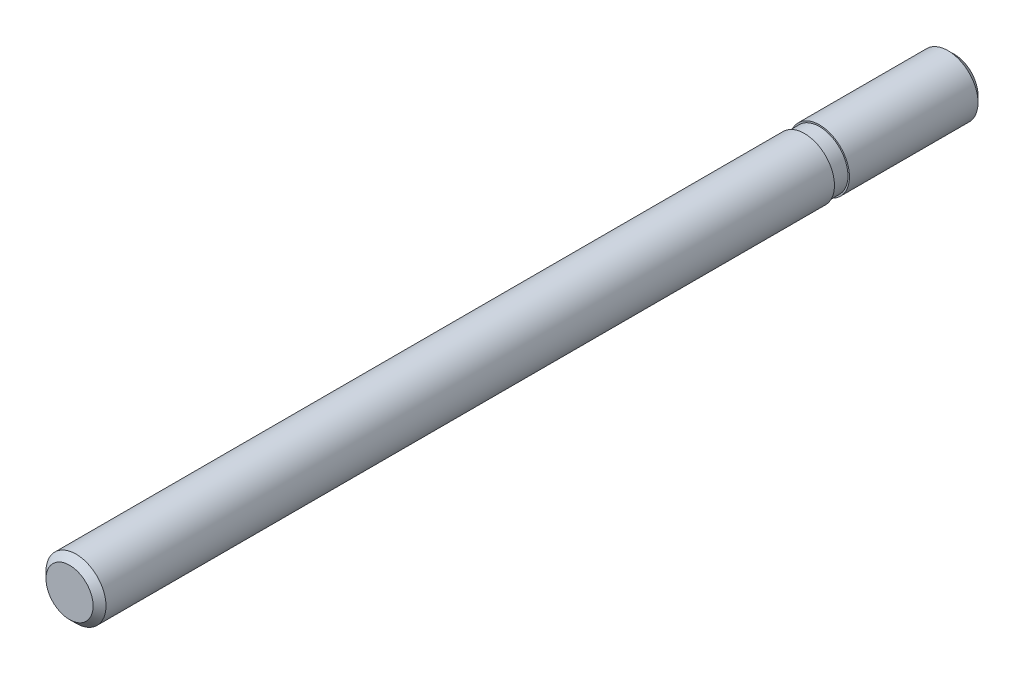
ISO-10303-21;
HEADER;
FILE_DESCRIPTION(('STEP AP214'),'2;1');
FILE_NAME('part.step','',(''),(''),'','','');
FILE_SCHEMA(('AUTOMOTIVE_DESIGN { 1 0 10303 214 1 1 1 1 }'));
ENDSEC;
DATA;
#1=APPLICATION_CONTEXT('core data for automotive mechanical design processes');
#2=APPLICATION_PROTOCOL_DEFINITION('international standard','automotive_design',2000,#1);
#3=PRODUCT_CONTEXT('',#1,'mechanical');
#4=PRODUCT('Part','Part','',(#3));
#5=PRODUCT_RELATED_PRODUCT_CATEGORY('part','',(#4));
#6=PRODUCT_DEFINITION_FORMATION('','',#4);
#7=PRODUCT_DEFINITION_CONTEXT('part definition',#1,'design');
#8=PRODUCT_DEFINITION('design','',#6,#7);
#9=PRODUCT_DEFINITION_SHAPE('','',#8);
#10=(LENGTH_UNIT() NAMED_UNIT(*) SI_UNIT(.MILLI.,.METRE.));
#11=(NAMED_UNIT(*) PLANE_ANGLE_UNIT() SI_UNIT($,.RADIAN.));
#12=(NAMED_UNIT(*) SI_UNIT($,.STERADIAN.) SOLID_ANGLE_UNIT());
#13=UNCERTAINTY_MEASURE_WITH_UNIT(LENGTH_MEASURE(1.E-05),#10,'distance_accuracy_value','');
#14=(GEOMETRIC_REPRESENTATION_CONTEXT(3) GLOBAL_UNCERTAINTY_ASSIGNED_CONTEXT((#13)) GLOBAL_UNIT_ASSIGNED_CONTEXT((#10,
#11,#12)) REPRESENTATION_CONTEXT('',''));
#15=CARTESIAN_POINT('',(0.,0.,0.));
#16=DIRECTION('',(0.,0.,1.));
#17=DIRECTION('',(1.,0.,0.));
#18=AXIS2_PLACEMENT_3D('',#15,#16,#17);
#19=CARTESIAN_POINT('',(0.,0.,7.5));
#20=DIRECTION('',(0.,0.,1.));
#21=DIRECTION('',(1.,0.,0.));
#22=AXIS2_PLACEMENT_3D('',#19,#20,#21);
#23=CYLINDRICAL_SURFACE('',#22,2.);
#24=CARTESIAN_POINT('',(0.,0.,0.));
#25=DIRECTION('',(0.,0.,1.));
#26=DIRECTION('',(1.,0.,0.));
#27=AXIS2_PLACEMENT_3D('',#24,#25,#26);
#28=CIRCLE('',#27,2.);
#29=CARTESIAN_POINT('',(2.,0.,0.));
#30=VERTEX_POINT('',#29);
#31=EDGE_CURVE('E19',#30,#30,#28,.T.);
#32=ORIENTED_EDGE('',*,*,#31,.F.);
#33=EDGE_LOOP('',(#32));
#34=FACE_BOUND('',#33,.T.);
#35=CARTESIAN_POINT('',(0.,0.,-8.5705));
#36=DIRECTION('',(0.,0.,1.));
#37=DIRECTION('',(1.,0.,0.));
#38=AXIS2_PLACEMENT_3D('',#35,#36,#37);
#39=CIRCLE('',#38,2.);
#40=CARTESIAN_POINT('',(2.,0.,-8.5705));
#41=VERTEX_POINT('',#40);
#42=EDGE_CURVE('E33',#41,#41,#39,.T.);
#43=ORIENTED_EDGE('',*,*,#42,.T.);
#44=EDGE_LOOP('',(#43));
#45=FACE_BOUND('',#44,.T.);
#46=ADVANCED_FACE('F12',(#34,#45),#23,.T.);
#47=CARTESIAN_POINT('',(0.,0.,0.));
#48=DIRECTION('',(0.,0.,1.));
#49=DIRECTION('',(1.,0.,0.));
#50=AXIS2_PLACEMENT_3D('',#47,#48,#49);
#51=PLANE('',#50);
#52=CARTESIAN_POINT('',(0.,0.,0.));
#53=DIRECTION('',(0.,0.,1.));
#54=DIRECTION('',(1.,0.,0.));
#55=AXIS2_PLACEMENT_3D('',#52,#53,#54);
#56=CIRCLE('',#55,1.9);
#57=CARTESIAN_POINT('',(1.9,0.,0.));
#58=VERTEX_POINT('',#57);
#59=EDGE_CURVE('E8',#58,#58,#56,.T.);
#60=ORIENTED_EDGE('',*,*,#59,.F.);
#61=EDGE_LOOP('',(#60));
#62=FACE_BOUND('',#61,.T.);
#63=ORIENTED_EDGE('',*,*,#31,.T.);
#64=EDGE_LOOP('',(#63));
#65=FACE_BOUND('',#64,.T.);
#66=ADVANCED_FACE('F69',(#62,#65),#51,.T.);
#67=CARTESIAN_POINT('',(0.,0.78525,-9.));
#68=DIRECTION('',(0.,0.,-1.));
#69=DIRECTION('',(-1.,0.,0.));
#70=AXIS2_PLACEMENT_3D('',#67,#68,#69);
#71=PLANE('',#70);
#72=CARTESIAN_POINT('',(0.,0.,-8.99999999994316));
#73=DIRECTION('',(0.,0.,1.));
#74=DIRECTION('',(1.,0.,0.));
#75=AXIS2_PLACEMENT_3D('',#72,#73,#74);
#76=CIRCLE('',#75,1.57050000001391);
#77=CARTESIAN_POINT('',(1.57050000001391,0.,-8.99999999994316));
#78=VERTEX_POINT('',#77);
#79=EDGE_CURVE('E36',#78,#78,#76,.T.);
#80=ORIENTED_EDGE('',*,*,#79,.F.);
#81=EDGE_LOOP('',(#80));
#82=FACE_BOUND('',#81,.T.);
#83=ADVANCED_FACE('F71',(#82),#71,.T.);
#84=CARTESIAN_POINT('',(0.,0.,-8.5705000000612));
#85=DIRECTION('',(0.,0.,1.));
#86=DIRECTION('',(1.,0.,0.));
#87=AXIS2_PLACEMENT_3D('',#84,#85,#86);
#88=CONICAL_SURFACE('',#87,1.9999999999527,0.785398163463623);
#89=ORIENTED_EDGE('',*,*,#42,.F.);
#90=EDGE_LOOP('',(#89));
#91=FACE_BOUND('',#90,.T.);
#92=ORIENTED_EDGE('',*,*,#79,.T.);
#93=EDGE_LOOP('',(#92));
#94=FACE_BOUND('',#93,.T.);
#95=ADVANCED_FACE('F79',(#91,#94),#88,.T.);
#96=CARTESIAN_POINT('',(0.,0.,-1.20159218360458));
#97=DIRECTION('',(0.,0.,-1.));
#98=DIRECTION('',(-1.,0.,0.));
#99=AXIS2_PLACEMENT_3D('',#96,#97,#98);
#100=CYLINDRICAL_SURFACE('',#99,1.9);
#101=CARTESIAN_POINT('',(0.,0.,1.));
#102=DIRECTION('',(0.,0.,-1.));
#103=DIRECTION('',(-1.,0.,0.));
#104=AXIS2_PLACEMENT_3D('',#101,#102,#103);
#105=CIRCLE('',#104,1.9);
#106=CARTESIAN_POINT('',(-1.9,0.,1.));
#107=VERTEX_POINT('',#106);
#108=EDGE_CURVE('E39',#107,#107,#105,.T.);
#109=ORIENTED_EDGE('',*,*,#108,.T.);
#110=EDGE_LOOP('',(#109));
#111=FACE_BOUND('',#110,.T.);
#112=ORIENTED_EDGE('',*,*,#59,.T.);
#113=EDGE_LOOP('',(#112));
#114=FACE_BOUND('',#113,.T.);
#115=ADVANCED_FACE('F45',(#111,#114),#100,.T.);
#116=CARTESIAN_POINT('',(0.,0.78525,50.));
#117=DIRECTION('',(0.,0.,1.));
#118=DIRECTION('',(1.,0.,0.));
#119=AXIS2_PLACEMENT_3D('',#116,#117,#118);
#120=PLANE('',#119);
#121=CARTESIAN_POINT('',(0.,0.,49.99999999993));
#122=DIRECTION('',(0.,0.,-1.));
#123=DIRECTION('',(-1.,0.,0.));
#124=AXIS2_PLACEMENT_3D('',#121,#122,#123);
#125=CIRCLE('',#124,1.57050000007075);
#126=CARTESIAN_POINT('',(-1.57050000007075,0.,49.99999999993));
#127=VERTEX_POINT('',#126);
#128=EDGE_CURVE('E30',#127,#127,#125,.T.);
#129=ORIENTED_EDGE('',*,*,#128,.F.);
#130=EDGE_LOOP('',(#129));
#131=FACE_BOUND('',#130,.T.);
#132=ADVANCED_FACE('F59',(#131),#120,.T.);
#133=CARTESIAN_POINT('',(0.,0.,49.5705000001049));
#134=DIRECTION('',(0.,0.,-1.));
#135=DIRECTION('',(-1.,0.,0.));
#136=AXIS2_PLACEMENT_3D('',#133,#134,#135);
#137=CONICAL_SURFACE('',#136,1.9999999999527,0.785398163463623);
#138=ORIENTED_EDGE('',*,*,#128,.T.);
#139=EDGE_LOOP('',(#138));
#140=FACE_BOUND('',#139,.T.);
#141=CARTESIAN_POINT('',(0.,0.,49.5705));
#142=DIRECTION('',(0.,0.,1.));
#143=DIRECTION('',(1.,0.,0.));
#144=AXIS2_PLACEMENT_3D('',#141,#142,#143);
#145=CIRCLE('',#144,2.);
#146=CARTESIAN_POINT('',(2.,0.,49.5705));
#147=VERTEX_POINT('',#146);
#148=EDGE_CURVE('E28',#147,#147,#145,.F.);
#149=ORIENTED_EDGE('',*,*,#148,.F.);
#150=EDGE_LOOP('',(#149));
#151=FACE_BOUND('',#150,.T.);
#152=ADVANCED_FACE('F55',(#140,#151),#137,.T.);
#153=CARTESIAN_POINT('',(0.,0.,7.5));
#154=DIRECTION('',(0.,0.,1.));
#155=DIRECTION('',(1.,0.,0.));
#156=AXIS2_PLACEMENT_3D('',#153,#154,#155);
#157=CYLINDRICAL_SURFACE('',#156,2.);
#158=CARTESIAN_POINT('',(0.,0.,1.));
#159=DIRECTION('',(0.,0.,1.));
#160=DIRECTION('',(1.,0.,0.));
#161=AXIS2_PLACEMENT_3D('',#158,#159,#160);
#162=CIRCLE('',#161,2.);
#163=CARTESIAN_POINT('',(2.,0.,1.));
#164=VERTEX_POINT('',#163);
#165=EDGE_CURVE('E23',#164,#164,#162,.T.);
#166=ORIENTED_EDGE('',*,*,#165,.T.);
#167=EDGE_LOOP('',(#166));
#168=FACE_BOUND('',#167,.T.);
#169=ORIENTED_EDGE('',*,*,#148,.T.);
#170=EDGE_LOOP('',(#169));
#171=FACE_BOUND('',#170,.T.);
#172=ADVANCED_FACE('F14',(#168,#171),#157,.T.);
#173=CARTESIAN_POINT('',(0.,0.,1.));
#174=DIRECTION('',(0.,0.,1.));
#175=DIRECTION('',(1.,0.,0.));
#176=AXIS2_PLACEMENT_3D('',#173,#174,#175);
#177=PLANE('',#176);
#178=ORIENTED_EDGE('',*,*,#108,.F.);
#179=EDGE_LOOP('',(#178));
#180=FACE_BOUND('',#179,.T.);
#181=ORIENTED_EDGE('',*,*,#165,.F.);
#182=EDGE_LOOP('',(#181));
#183=FACE_BOUND('',#182,.T.);
#184=ADVANCED_FACE('F47',(#180,#183),#177,.F.);
#185=CLOSED_SHELL('',(#46,#66,#83,#95,#115,#132,#152,#172,#184));
#186=MANIFOLD_SOLID_BREP('B1',#185);
#187=ADVANCED_BREP_SHAPE_REPRESENTATION('',(#18,#186),#14);
#188=SHAPE_DEFINITION_REPRESENTATION(#9,#187);
ENDSEC;
END-ISO-10303-21;
